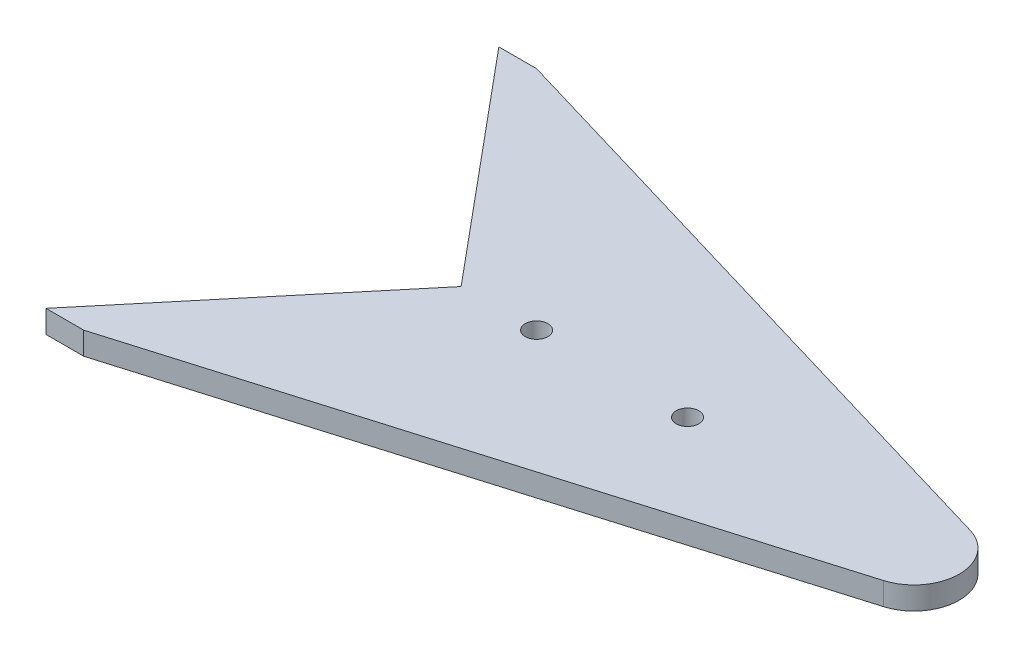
from build123d import *

# Parameters (mm, degrees)
SKETCH1_R      = 1.5
EXTRUDE1_DEPTH = 3


with BuildPart() as part:
    # Sketch1 → Extrude1 (new body)
    with BuildSketch(Plane(origin=(0, 0, 0), x_dir=(1, 0, 0), z_dir=(0, 1, 0))):
        with BuildLine():
            Line((0, 30), (5, 30))
            Line((5, 30), (86.7070501, 5.752190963))
            ThreePointArc((86.7070501, 5.752190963), (91.000143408, 0), (86.7070501, -5.752190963))
            Line((86.7070501, -5.752190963), (5, -30))
            Line((5, -30), (0, -30))
            Line((0, -30), (25, 0))
            Line((25, 0), (0, 30))
        make_face()
        with Locations(Location((35, 0, 0), (0, 0, 270))):
            Circle(SKETCH1_R, mode=Mode.SUBTRACT)
        with Locations(Location((55, 0, 0), (0, 0, 270))):
            Circle(SKETCH1_R, mode=Mode.SUBTRACT)
    extrude(amount=EXTRUDE1_DEPTH)


solid = part.part
